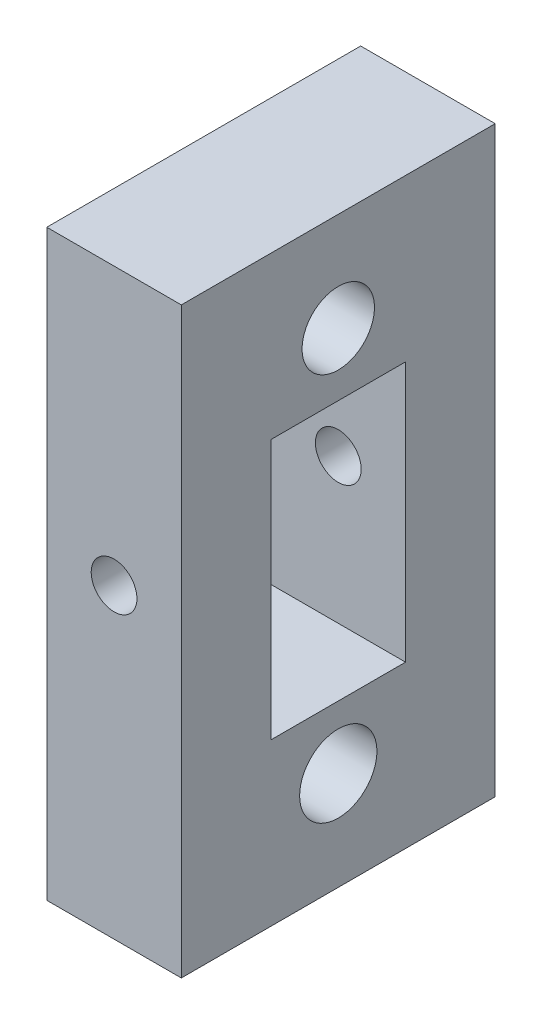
from build123d import *

# Parameters (mm, degrees)
ESQUISSE1_W                  = 15
ESQUISSE1_H                  = 65
BOSS_EXTRU_1_DEPTH           = 10
ESQUISSE2_W                  = 15
ESQUISSE2_H                  = 18
BOSS_EXTRU_2_DEPTH           = 15
ESQUISSE3_W                  = 15
ESQUISSE3_H                  = 18
BOSS_EXTRU_3_DEPTH           = 15
ESQUISSE4_W                  = 15
ESQUISSE4_H                  = 65
BOSS_EXTRU_4_DEPTH           = 10
ESQUISSE5_R                  = 4.037288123
ESQUISSE5_R_2                = 4.308615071
ENL_V_MAT_EXTRU_1_DEPTH      = 45.907513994
ENL_V_MAT_EXTRU_2_DEPTH      = 80.776692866
ENL_V_MAT_EXTRU_2_DEPTH_BACK = 80.776692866
ESQUISSE7_R                  = 2.55


with BuildPart() as part:
    # Esquisse1 → Boss.-Extru.1 (new body)
    with BuildSketch(Plane.XY):
        with Locations((-60.12126819, -1.65676819)):
            Rectangle(ESQUISSE1_W, ESQUISSE1_H)
    extrude(amount=BOSS_EXTRU_1_DEPTH)

    # Esquisse2 → Boss.-Extru.2 (add)
    with BuildSketch(Plane(origin=(0, 0, 0), x_dir=(-1, 0, 0), z_dir=(0, 0, -1))):
        with Locations((60.12126819, 21.84323181)):
            Rectangle(ESQUISSE2_W, ESQUISSE2_H)
    extrude(amount=BOSS_EXTRU_2_DEPTH)

    # Esquisse3 → Boss.-Extru.3 (add)
    with BuildSketch(Plane(origin=(0, 0, 0), x_dir=(-1, 0, 0), z_dir=(0, 0, -1))):
        with Locations((60.12126819, -25.15676819)):
            Rectangle(ESQUISSE3_W, ESQUISSE3_H)
    extrude(amount=BOSS_EXTRU_3_DEPTH)

    # Esquisse4 → Boss.-Extru.4 (add)
    with BuildSketch(Plane(origin=(0, 0, -15), x_dir=(-1, 0, 0), z_dir=(0, 0, -1))):
        with Locations((60.12126819, -1.65676819)):
            Rectangle(ESQUISSE4_W, ESQUISSE4_H)
    extrude(amount=BOSS_EXTRU_4_DEPTH)

    # Esquisse5 → Enl_v. mat.-Extru.1 (cut, through all)
    with BuildSketch(Plane.ZY.offset(67.62126819)):
        with Locations((-7.5, 19.84323181)):
            Circle(ESQUISSE5_R)
        with Locations((-7.5, -23.15676819)):
            Circle(ESQUISSE5_R_2)
    extrude(amount=-ENL_V_MAT_EXTRU_1_DEPTH, mode=Mode.SUBTRACT)

    # Esquisse7 → Enl_v. mat.-Extru.2 (cut, two sides: drawn at the far end of the back side and taken through both)
    with BuildSketch(Plane(origin=(0, 0, 0), x_dir=(-1, 0, 0), z_dir=(0, 0, -1)).offset(-ENL_V_MAT_EXTRU_2_DEPTH_BACK)):
        with Locations((60.12126819, 0)):
            Circle(ESQUISSE7_R)
    extrude(amount=ENL_V_MAT_EXTRU_2_DEPTH + ENL_V_MAT_EXTRU_2_DEPTH_BACK, mode=Mode.SUBTRACT)


solid = part.part
